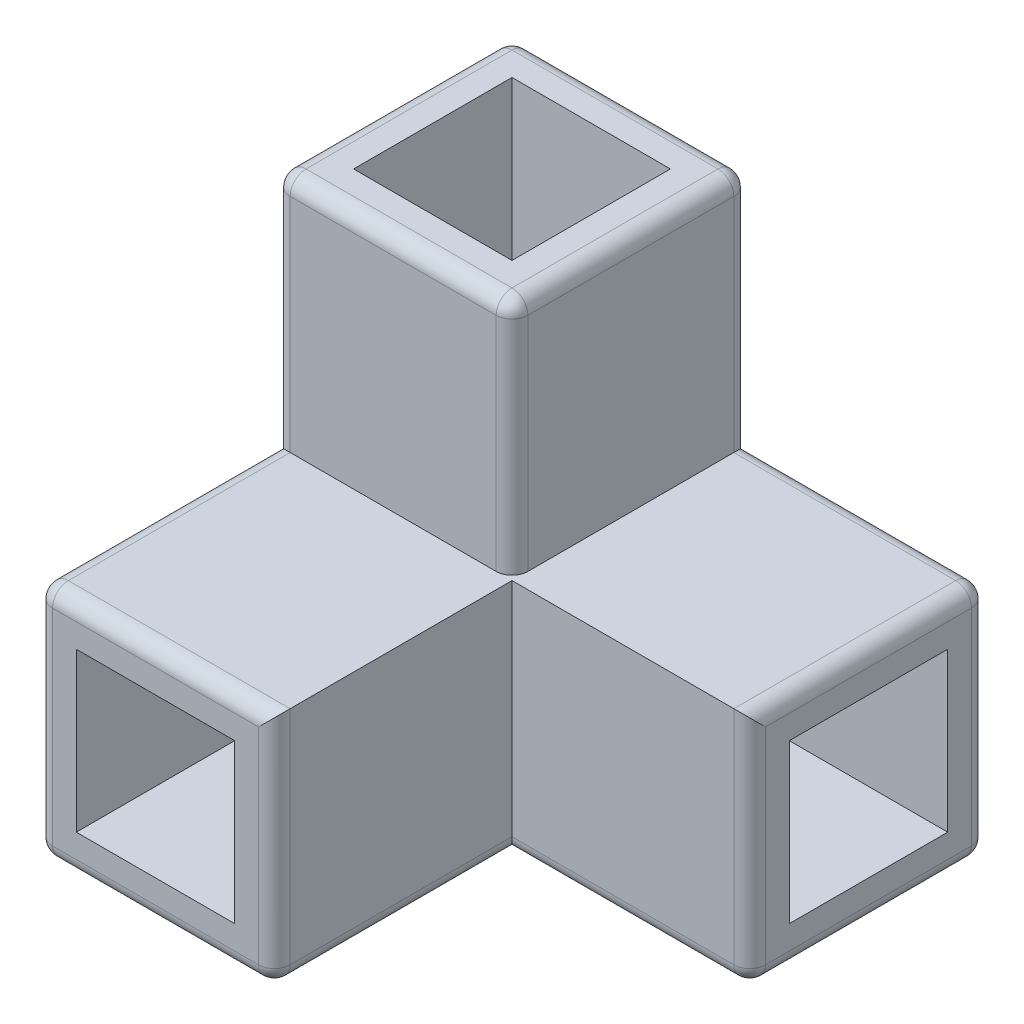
ISO-10303-21;
HEADER;
FILE_DESCRIPTION(('STEP AP214'),'2;1');
FILE_NAME('part.step','',(''),(''),'','','');
FILE_SCHEMA(('AUTOMOTIVE_DESIGN { 1 0 10303 214 1 1 1 1 }'));
ENDSEC;
DATA;
#1=APPLICATION_CONTEXT('core data for automotive mechanical design processes');
#2=APPLICATION_PROTOCOL_DEFINITION('international standard','automotive_design',2000,#1);
#3=PRODUCT_CONTEXT('',#1,'mechanical');
#4=PRODUCT('Part','Part','',(#3));
#5=PRODUCT_RELATED_PRODUCT_CATEGORY('part','',(#4));
#6=PRODUCT_DEFINITION_FORMATION('','',#4);
#7=PRODUCT_DEFINITION_CONTEXT('part definition',#1,'design');
#8=PRODUCT_DEFINITION('design','',#6,#7);
#9=PRODUCT_DEFINITION_SHAPE('','',#8);
#10=(LENGTH_UNIT() NAMED_UNIT(*) SI_UNIT(.MILLI.,.METRE.));
#11=(NAMED_UNIT(*) PLANE_ANGLE_UNIT() SI_UNIT($,.RADIAN.));
#12=(NAMED_UNIT(*) SI_UNIT($,.STERADIAN.) SOLID_ANGLE_UNIT());
#13=UNCERTAINTY_MEASURE_WITH_UNIT(LENGTH_MEASURE(1.E-05),#10,'distance_accuracy_value','');
#14=(GEOMETRIC_REPRESENTATION_CONTEXT(3) GLOBAL_UNCERTAINTY_ASSIGNED_CONTEXT((#13)) GLOBAL_UNIT_ASSIGNED_CONTEXT((#10,
#11,#12)) REPRESENTATION_CONTEXT('',''));
#15=CARTESIAN_POINT('',(0.,0.,0.));
#16=DIRECTION('',(0.,0.,1.));
#17=DIRECTION('',(1.,0.,0.));
#18=AXIS2_PLACEMENT_3D('',#15,#16,#17);
#19=CARTESIAN_POINT('',(0.,0.,30.));
#20=DIRECTION('',(0.,0.,-1.));
#21=DIRECTION('',(-1.,0.,0.));
#22=AXIS2_PLACEMENT_3D('',#19,#20,#21);
#23=PLANE('',#22);
#24=DIRECTION('',(0.,1.,0.));
#25=VECTOR('',#24,1.);
#26=CARTESIAN_POINT('',(30.,0.,30.));
#27=LINE('',#26,#25);
#28=CARTESIAN_POINT('',(30.,2.,30.));
#29=VERTEX_POINT('',#28);
#30=CARTESIAN_POINT('',(30.,30.,30.));
#31=VERTEX_POINT('',#30);
#32=EDGE_CURVE('E410',#29,#31,#27,.T.);
#33=ORIENTED_EDGE('',*,*,#32,.F.);
#34=DIRECTION('',(1.,0.,0.));
#35=VECTOR('',#34,1.);
#36=CARTESIAN_POINT('',(0.,2.,30.));
#37=LINE('',#36,#35);
#38=CARTESIAN_POINT('',(58.,2.,30.));
#39=VERTEX_POINT('',#38);
#40=EDGE_CURVE('E509',#29,#39,#37,.T.);
#41=ORIENTED_EDGE('',*,*,#40,.T.);
#42=DIRECTION('',(0.,1.,0.));
#43=VECTOR('',#42,1.);
#44=CARTESIAN_POINT('',(58.,0.,30.));
#45=LINE('',#44,#43);
#46=CARTESIAN_POINT('',(58.,30.,30.));
#47=VERTEX_POINT('',#46);
#48=EDGE_CURVE('E506',#39,#47,#45,.T.);
#49=ORIENTED_EDGE('',*,*,#48,.T.);
#50=DIRECTION('',(-1.,0.,0.));
#51=VECTOR('',#50,1.);
#52=CARTESIAN_POINT('',(30.,30.,30.));
#53=LINE('',#52,#51);
#54=EDGE_CURVE('E421',#47,#31,#53,.T.);
#55=ORIENTED_EDGE('',*,*,#54,.T.);
#56=EDGE_LOOP('',(#33,#41,#49,#55));
#57=FACE_BOUND('',#56,.T.);
#58=ADVANCED_FACE('F43',(#57),#23,.F.);
#59=DIRECTION('',(-1.,0.,0.));
#60=VECTOR('',#59,1.);
#61=CARTESIAN_POINT('',(30.,30.,30.));
#62=LINE('',#61,#60);
#63=CARTESIAN_POINT('',(28.,30.,30.));
#64=VERTEX_POINT('',#63);
#65=CARTESIAN_POINT('',(2.00000000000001,30.,30.));
#66=VERTEX_POINT('',#65);
#67=EDGE_CURVE('E414',#64,#66,#62,.T.);
#68=ORIENTED_EDGE('',*,*,#67,.F.);
#69=DIRECTION('',(0.,1.,0.));
#70=VECTOR('',#69,1.);
#71=CARTESIAN_POINT('',(28.,0.,30.));
#72=LINE('',#71,#70);
#73=CARTESIAN_POINT('',(28.,58.,30.));
#74=VERTEX_POINT('',#73);
#75=EDGE_CURVE('E552',#64,#74,#72,.T.);
#76=ORIENTED_EDGE('',*,*,#75,.T.);
#77=DIRECTION('',(-1.,0.,0.));
#78=VECTOR('',#77,1.);
#79=CARTESIAN_POINT('',(0.,58.,30.));
#80=LINE('',#79,#78);
#81=CARTESIAN_POINT('',(2.,58.,30.));
#82=VERTEX_POINT('',#81);
#83=EDGE_CURVE('E546',#74,#82,#80,.T.);
#84=ORIENTED_EDGE('',*,*,#83,.T.);
#85=DIRECTION('',(0.,-1.,0.));
#86=VECTOR('',#85,1.);
#87=CARTESIAN_POINT('',(2.,0.,30.));
#88=LINE('',#87,#86);
#89=EDGE_CURVE('E549',#82,#66,#88,.T.);
#90=ORIENTED_EDGE('',*,*,#89,.T.);
#91=EDGE_LOOP('',(#68,#76,#84,#90));
#92=FACE_BOUND('',#91,.T.);
#93=ADVANCED_FACE('F731',(#92),#23,.F.);
#94=CARTESIAN_POINT('',(60.,30.,30.));
#95=DIRECTION('',(-1.,0.,0.));
#96=DIRECTION('',(0.,-1.,0.));
#97=AXIS2_PLACEMENT_3D('',#94,#95,#96);
#98=PLANE('',#97);
#99=DIRECTION('',(0.,0.,1.));
#100=VECTOR('',#99,1.);
#101=CARTESIAN_POINT('',(60.,25.,25.));
#102=LINE('',#101,#100);
#103=CARTESIAN_POINT('',(60.,25.,5.00000000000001));
#104=VERTEX_POINT('',#103);
#105=CARTESIAN_POINT('',(60.,25.,25.));
#106=VERTEX_POINT('',#105);
#107=EDGE_CURVE('E343',#104,#106,#102,.T.);
#108=ORIENTED_EDGE('',*,*,#107,.F.);
#109=DIRECTION('',(0.,1.,0.));
#110=VECTOR('',#109,1.);
#111=CARTESIAN_POINT('',(60.,25.,5.00000000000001));
#112=LINE('',#111,#110);
#113=CARTESIAN_POINT('',(60.,5.,5.));
#114=VERTEX_POINT('',#113);
#115=EDGE_CURVE('E69',#114,#104,#112,.T.);
#116=ORIENTED_EDGE('',*,*,#115,.F.);
#117=DIRECTION('',(0.,0.,-1.));
#118=VECTOR('',#117,1.);
#119=CARTESIAN_POINT('',(60.,5.,25.));
#120=LINE('',#119,#118);
#121=CARTESIAN_POINT('',(60.,5.,25.));
#122=VERTEX_POINT('',#121);
#123=EDGE_CURVE('E328',#122,#114,#120,.T.);
#124=ORIENTED_EDGE('',*,*,#123,.F.);
#125=DIRECTION('',(0.,-1.,0.));
#126=VECTOR('',#125,1.);
#127=CARTESIAN_POINT('',(60.,25.,25.));
#128=LINE('',#127,#126);
#129=EDGE_CURVE('E347',#106,#122,#128,.T.);
#130=ORIENTED_EDGE('',*,*,#129,.F.);
#131=EDGE_LOOP('',(#108,#116,#124,#130));
#132=FACE_BOUND('',#131,.T.);
#133=DIRECTION('',(0.,0.,-1.));
#134=VECTOR('',#133,1.);
#135=CARTESIAN_POINT('',(60.,28.,30.));
#136=LINE('',#135,#134);
#137=CARTESIAN_POINT('',(60.,28.,2.));
#138=VERTEX_POINT('',#137);
#139=CARTESIAN_POINT('',(60.,28.,28.));
#140=VERTEX_POINT('',#139);
#141=EDGE_CURVE('E442',#138,#140,#136,.F.);
#142=ORIENTED_EDGE('',*,*,#141,.T.);
#143=DIRECTION('',(0.,1.,0.));
#144=VECTOR('',#143,1.);
#145=CARTESIAN_POINT('',(60.,30.,28.));
#146=LINE('',#145,#144);
#147=CARTESIAN_POINT('',(60.,2.,28.));
#148=VERTEX_POINT('',#147);
#149=EDGE_CURVE('E446',#140,#148,#146,.F.);
#150=ORIENTED_EDGE('',*,*,#149,.T.);
#151=DIRECTION('',(0.,0.,-1.));
#152=VECTOR('',#151,1.);
#153=CARTESIAN_POINT('',(60.,2.,30.));
#154=LINE('',#153,#152);
#155=CARTESIAN_POINT('',(60.,2.,2.));
#156=VERTEX_POINT('',#155);
#157=EDGE_CURVE('E439',#148,#156,#154,.T.);
#158=ORIENTED_EDGE('',*,*,#157,.T.);
#159=DIRECTION('',(0.,1.,0.));
#160=VECTOR('',#159,1.);
#161=CARTESIAN_POINT('',(60.,30.,2.));
#162=LINE('',#161,#160);
#163=EDGE_CURVE('E436',#156,#138,#162,.T.);
#164=ORIENTED_EDGE('',*,*,#163,.T.);
#165=EDGE_LOOP('',(#142,#150,#158,#164));
#166=FACE_BOUND('',#165,.T.);
#167=ADVANCED_FACE('F788',(#132,#166),#98,.F.);
#168=CARTESIAN_POINT('',(30.,30.,30.));
#169=DIRECTION('',(0.,-1.,0.));
#170=DIRECTION('',(0.,0.,-1.));
#171=AXIS2_PLACEMENT_3D('',#168,#169,#170);
#172=PLANE('',#171);
#173=ORIENTED_EDGE('',*,*,#54,.F.);
#174=DIRECTION('',(0.,0.,-1.));
#175=VECTOR('',#174,1.);
#176=CARTESIAN_POINT('',(58.,30.,30.));
#177=LINE('',#176,#175);
#178=CARTESIAN_POINT('',(58.,30.,2.));
#179=VERTEX_POINT('',#178);
#180=EDGE_CURVE('E432',#47,#179,#177,.T.);
#181=ORIENTED_EDGE('',*,*,#180,.T.);
#182=DIRECTION('',(-1.,0.,0.));
#183=VECTOR('',#182,1.);
#184=CARTESIAN_POINT('',(30.,30.,2.));
#185=LINE('',#184,#183);
#186=CARTESIAN_POINT('',(30.,30.,2.));
#187=VERTEX_POINT('',#186);
#188=EDGE_CURVE('E429',#179,#187,#185,.T.);
#189=ORIENTED_EDGE('',*,*,#188,.T.);
#190=DIRECTION('',(0.,0.,-1.));
#191=VECTOR('',#190,1.);
#192=CARTESIAN_POINT('',(30.,30.,30.));
#193=LINE('',#192,#191);
#194=CARTESIAN_POINT('',(30.,30.,28.));
#195=VERTEX_POINT('',#194);
#196=EDGE_CURVE('E425',#195,#187,#193,.T.);
#197=ORIENTED_EDGE('',*,*,#196,.F.);
#198=CARTESIAN_POINT('',(28.,30.,28.));
#199=DIRECTION('',(0.,-1.,0.));
#200=DIRECTION('',(0.,0.,-1.));
#201=AXIS2_PLACEMENT_3D('',#198,#199,#200);
#202=CIRCLE('',#201,2.);
#203=EDGE_CURVE('E11',#195,#64,#202,.T.);
#204=ORIENTED_EDGE('',*,*,#203,.T.);
#205=ORIENTED_EDGE('',*,*,#67,.T.);
#206=DIRECTION('',(0.,0.,-1.));
#207=VECTOR('',#206,1.);
#208=CARTESIAN_POINT('',(2.,30.,60.));
#209=LINE('',#208,#207);
#210=CARTESIAN_POINT('',(2.,30.,58.));
#211=VERTEX_POINT('',#210);
#212=EDGE_CURVE('E531',#66,#211,#209,.F.);
#213=ORIENTED_EDGE('',*,*,#212,.T.);
#214=DIRECTION('',(-1.,0.,0.));
#215=VECTOR('',#214,1.);
#216=CARTESIAN_POINT('',(30.,30.,58.));
#217=LINE('',#216,#215);
#218=CARTESIAN_POINT('',(30.,30.,58.));
#219=VERTEX_POINT('',#218);
#220=EDGE_CURVE('E534',#211,#219,#217,.F.);
#221=ORIENTED_EDGE('',*,*,#220,.T.);
#222=DIRECTION('',(0.,0.,-1.));
#223=VECTOR('',#222,1.);
#224=CARTESIAN_POINT('',(30.,30.,60.));
#225=LINE('',#224,#223);
#226=EDGE_CURVE('E418',#219,#31,#225,.T.);
#227=ORIENTED_EDGE('',*,*,#226,.T.);
#228=EDGE_LOOP('',(#173,#181,#189,#197,#204,#205,#213,#221,#227));
#229=FACE_BOUND('',#228,.T.);
#230=ADVANCED_FACE('F724',(#229),#172,.F.);
#231=CARTESIAN_POINT('',(30.,60.,30.));
#232=DIRECTION('',(-1.,0.,0.));
#233=DIRECTION('',(0.,-1.,0.));
#234=AXIS2_PLACEMENT_3D('',#231,#232,#233);
#235=PLANE('',#234);
#236=ORIENTED_EDGE('',*,*,#196,.T.);
#237=DIRECTION('',(0.,1.,0.));
#238=VECTOR('',#237,1.);
#239=CARTESIAN_POINT('',(30.,60.,2.));
#240=LINE('',#239,#238);
#241=CARTESIAN_POINT('',(30.,58.,2.));
#242=VERTEX_POINT('',#241);
#243=EDGE_CURVE('E543',#187,#242,#240,.T.);
#244=ORIENTED_EDGE('',*,*,#243,.T.);
#245=DIRECTION('',(0.,0.,-1.));
#246=VECTOR('',#245,1.);
#247=CARTESIAN_POINT('',(30.,58.,30.));
#248=LINE('',#247,#246);
#249=CARTESIAN_POINT('',(30.,58.,28.));
#250=VERTEX_POINT('',#249);
#251=EDGE_CURVE('E537',#242,#250,#248,.F.);
#252=ORIENTED_EDGE('',*,*,#251,.T.);
#253=DIRECTION('',(0.,1.,0.));
#254=VECTOR('',#253,1.);
#255=CARTESIAN_POINT('',(30.,60.,28.));
#256=LINE('',#255,#254);
#257=EDGE_CURVE('E540',#250,#195,#256,.F.);
#258=ORIENTED_EDGE('',*,*,#257,.T.);
#259=EDGE_LOOP('',(#236,#244,#252,#258));
#260=FACE_BOUND('',#259,.T.);
#261=ADVANCED_FACE('F808',(#260),#235,.F.);
#262=CARTESIAN_POINT('',(0.,60.,30.));
#263=DIRECTION('',(0.,-1.,0.));
#264=DIRECTION('',(0.,0.,-1.));
#265=AXIS2_PLACEMENT_3D('',#262,#263,#264);
#266=PLANE('',#265);
#267=DIRECTION('',(-1.,0.,0.));
#268=VECTOR('',#267,1.);
#269=CARTESIAN_POINT('',(5.,60.,5.));
#270=LINE('',#269,#268);
#271=CARTESIAN_POINT('',(25.,60.,5.));
#272=VERTEX_POINT('',#271);
#273=CARTESIAN_POINT('',(5.,60.,5.));
#274=VERTEX_POINT('',#273);
#275=EDGE_CURVE('E309',#272,#274,#270,.T.);
#276=ORIENTED_EDGE('',*,*,#275,.F.);
#277=DIRECTION('',(0.,0.,-1.));
#278=VECTOR('',#277,1.);
#279=CARTESIAN_POINT('',(25.,60.,5.));
#280=LINE('',#279,#278);
#281=CARTESIAN_POINT('',(25.,60.,25.));
#282=VERTEX_POINT('',#281);
#283=EDGE_CURVE('E61',#282,#272,#280,.T.);
#284=ORIENTED_EDGE('',*,*,#283,.F.);
#285=DIRECTION('',(1.,0.,0.));
#286=VECTOR('',#285,1.);
#287=CARTESIAN_POINT('',(5.,60.,25.));
#288=LINE('',#287,#286);
#289=CARTESIAN_POINT('',(5.,60.,25.));
#290=VERTEX_POINT('',#289);
#291=EDGE_CURVE('E296',#290,#282,#288,.T.);
#292=ORIENTED_EDGE('',*,*,#291,.F.);
#293=DIRECTION('',(0.,0.,1.));
#294=VECTOR('',#293,1.);
#295=CARTESIAN_POINT('',(5.,60.,5.));
#296=LINE('',#295,#294);
#297=EDGE_CURVE('E300',#274,#290,#296,.T.);
#298=ORIENTED_EDGE('',*,*,#297,.F.);
#299=EDGE_LOOP('',(#276,#284,#292,#298));
#300=FACE_BOUND('',#299,.T.);
#301=DIRECTION('',(0.,0.,-1.));
#302=VECTOR('',#301,1.);
#303=CARTESIAN_POINT('',(2.,60.,30.));
#304=LINE('',#303,#302);
#305=CARTESIAN_POINT('',(2.,60.,2.));
#306=VERTEX_POINT('',#305);
#307=CARTESIAN_POINT('',(2.,60.,28.));
#308=VERTEX_POINT('',#307);
#309=EDGE_CURVE('E555',#306,#308,#304,.F.);
#310=ORIENTED_EDGE('',*,*,#309,.T.);
#311=DIRECTION('',(-1.,0.,0.));
#312=VECTOR('',#311,1.);
#313=CARTESIAN_POINT('',(0.,60.,28.));
#314=LINE('',#313,#312);
#315=CARTESIAN_POINT('',(28.,60.,28.));
#316=VERTEX_POINT('',#315);
#317=EDGE_CURVE('E53',#308,#316,#314,.F.);
#318=ORIENTED_EDGE('',*,*,#317,.T.);
#319=DIRECTION('',(0.,0.,-1.));
#320=VECTOR('',#319,1.);
#321=CARTESIAN_POINT('',(28.,60.,30.));
#322=LINE('',#321,#320);
#323=CARTESIAN_POINT('',(28.,60.,2.));
#324=VERTEX_POINT('',#323);
#325=EDGE_CURVE('E561',#316,#324,#322,.T.);
#326=ORIENTED_EDGE('',*,*,#325,.T.);
#327=DIRECTION('',(-1.,0.,0.));
#328=VECTOR('',#327,1.);
#329=CARTESIAN_POINT('',(0.,60.,2.));
#330=LINE('',#329,#328);
#331=EDGE_CURVE('E558',#324,#306,#330,.T.);
#332=ORIENTED_EDGE('',*,*,#331,.T.);
#333=EDGE_LOOP('',(#310,#318,#326,#332));
#334=FACE_BOUND('',#333,.T.);
#335=ADVANCED_FACE('F751',(#300,#334),#266,.F.);
#336=CARTESIAN_POINT('',(0.,0.,30.));
#337=DIRECTION('',(1.,0.,0.));
#338=DIRECTION('',(0.,0.,-1.));
#339=AXIS2_PLACEMENT_3D('',#336,#337,#338);
#340=PLANE('',#339);
#341=DIRECTION('',(0.,-1.,0.));
#342=VECTOR('',#341,1.);
#343=CARTESIAN_POINT('',(0.,0.,2.));
#344=LINE('',#343,#342);
#345=CARTESIAN_POINT('',(0.,58.,2.));
#346=VERTEX_POINT('',#345);
#347=CARTESIAN_POINT('',(0.,2.,2.));
#348=VERTEX_POINT('',#347);
#349=EDGE_CURVE('E474',#346,#348,#344,.T.);
#350=ORIENTED_EDGE('',*,*,#349,.T.);
#351=DIRECTION('',(0.,0.,-1.));
#352=VECTOR('',#351,1.);
#353=CARTESIAN_POINT('',(0.,2.,30.));
#354=LINE('',#353,#352);
#355=CARTESIAN_POINT('',(0.,2.,58.));
#356=VERTEX_POINT('',#355);
#357=EDGE_CURVE('E483',#348,#356,#354,.F.);
#358=ORIENTED_EDGE('',*,*,#357,.T.);
#359=DIRECTION('',(0.,-1.,0.));
#360=VECTOR('',#359,1.);
#361=CARTESIAN_POINT('',(0.,30.,58.));
#362=LINE('',#361,#360);
#363=CARTESIAN_POINT('',(0.,28.,58.));
#364=VERTEX_POINT('',#363);
#365=EDGE_CURVE('E480',#356,#364,#362,.F.);
#366=ORIENTED_EDGE('',*,*,#365,.T.);
#367=DIRECTION('',(0.,0.,-1.));
#368=VECTOR('',#367,1.);
#369=CARTESIAN_POINT('',(0.,28.,30.));
#370=LINE('',#369,#368);
#371=CARTESIAN_POINT('',(0.,28.,28.));
#372=VERTEX_POINT('',#371);
#373=EDGE_CURVE('E477',#364,#372,#370,.T.);
#374=ORIENTED_EDGE('',*,*,#373,.T.);
#375=DIRECTION('',(0.,-1.,0.));
#376=VECTOR('',#375,1.);
#377=CARTESIAN_POINT('',(0.,0.,28.));
#378=LINE('',#377,#376);
#379=CARTESIAN_POINT('',(0.,58.,28.));
#380=VERTEX_POINT('',#379);
#381=EDGE_CURVE('E471',#372,#380,#378,.F.);
#382=ORIENTED_EDGE('',*,*,#381,.T.);
#383=DIRECTION('',(0.,0.,-1.));
#384=VECTOR('',#383,1.);
#385=CARTESIAN_POINT('',(0.,58.,30.));
#386=LINE('',#385,#384);
#387=EDGE_CURVE('E468',#380,#346,#386,.T.);
#388=ORIENTED_EDGE('',*,*,#387,.T.);
#389=EDGE_LOOP('',(#350,#358,#366,#374,#382,#388));
#390=FACE_BOUND('',#389,.T.);
#391=ADVANCED_FACE('F801',(#390),#340,.F.);
#392=CARTESIAN_POINT('',(60.,0.,30.));
#393=DIRECTION('',(0.,1.,0.));
#394=DIRECTION('',(-1.,0.,0.));
#395=AXIS2_PLACEMENT_3D('',#392,#393,#394);
#396=PLANE('',#395);
#397=DIRECTION('',(1.,0.,0.));
#398=VECTOR('',#397,1.);
#399=CARTESIAN_POINT('',(0.,0.,58.));
#400=LINE('',#399,#398);
#401=CARTESIAN_POINT('',(28.,0.,58.));
#402=VERTEX_POINT('',#401);
#403=CARTESIAN_POINT('',(2.,0.,58.));
#404=VERTEX_POINT('',#403);
#405=EDGE_CURVE('E449',#402,#404,#400,.F.);
#406=ORIENTED_EDGE('',*,*,#405,.T.);
#407=DIRECTION('',(0.,0.,-1.));
#408=VECTOR('',#407,1.);
#409=CARTESIAN_POINT('',(2.,0.,30.));
#410=LINE('',#409,#408);
#411=CARTESIAN_POINT('',(2.,0.,2.));
#412=VERTEX_POINT('',#411);
#413=EDGE_CURVE('E464',#404,#412,#410,.T.);
#414=ORIENTED_EDGE('',*,*,#413,.T.);
#415=DIRECTION('',(1.,0.,0.));
#416=VECTOR('',#415,1.);
#417=CARTESIAN_POINT('',(60.,0.,2.));
#418=LINE('',#417,#416);
#419=CARTESIAN_POINT('',(58.,0.,2.));
#420=VERTEX_POINT('',#419);
#421=EDGE_CURVE('E461',#412,#420,#418,.T.);
#422=ORIENTED_EDGE('',*,*,#421,.T.);
#423=DIRECTION('',(0.,0.,-1.));
#424=VECTOR('',#423,1.);
#425=CARTESIAN_POINT('',(58.,0.,30.));
#426=LINE('',#425,#424);
#427=CARTESIAN_POINT('',(58.,0.,28.));
#428=VERTEX_POINT('',#427);
#429=EDGE_CURVE('E458',#420,#428,#426,.F.);
#430=ORIENTED_EDGE('',*,*,#429,.T.);
#431=DIRECTION('',(1.,0.,0.));
#432=VECTOR('',#431,1.);
#433=CARTESIAN_POINT('',(60.,0.,28.));
#434=LINE('',#433,#432);
#435=CARTESIAN_POINT('',(28.,0.,28.));
#436=VERTEX_POINT('',#435);
#437=EDGE_CURVE('E455',#428,#436,#434,.F.);
#438=ORIENTED_EDGE('',*,*,#437,.T.);
#439=DIRECTION('',(0.,0.,-1.));
#440=VECTOR('',#439,1.);
#441=CARTESIAN_POINT('',(28.,0.,30.));
#442=LINE('',#441,#440);
#443=EDGE_CURVE('E452',#436,#402,#442,.F.);
#444=ORIENTED_EDGE('',*,*,#443,.T.);
#445=EDGE_LOOP('',(#406,#414,#422,#430,#438,#444));
#446=FACE_BOUND('',#445,.T.);
#447=ADVANCED_FACE('F797',(#446),#396,.F.);
#448=CARTESIAN_POINT('',(0.,0.,0.));
#449=DIRECTION('',(0.,0.,-1.));
#450=DIRECTION('',(-1.,0.,0.));
#451=AXIS2_PLACEMENT_3D('',#448,#449,#450);
#452=PLANE('',#451);
#453=DIRECTION('',(0.,1.,0.));
#454=VECTOR('',#453,1.);
#455=CARTESIAN_POINT('',(58.,0.,0.));
#456=LINE('',#455,#454);
#457=CARTESIAN_POINT('',(58.,28.,0.));
#458=VERTEX_POINT('',#457);
#459=CARTESIAN_POINT('',(58.,2.,0.));
#460=VERTEX_POINT('',#459);
#461=EDGE_CURVE('E499',#458,#460,#456,.F.);
#462=ORIENTED_EDGE('',*,*,#461,.T.);
#463=DIRECTION('',(1.,0.,0.));
#464=VECTOR('',#463,1.);
#465=CARTESIAN_POINT('',(0.,2.,0.));
#466=LINE('',#465,#464);
#467=CARTESIAN_POINT('',(2.,2.,0.));
#468=VERTEX_POINT('',#467);
#469=EDGE_CURVE('E502',#460,#468,#466,.F.);
#470=ORIENTED_EDGE('',*,*,#469,.T.);
#471=DIRECTION('',(0.,-1.,0.));
#472=VECTOR('',#471,1.);
#473=CARTESIAN_POINT('',(2.,60.,0.));
#474=LINE('',#473,#472);
#475=CARTESIAN_POINT('',(2.,58.,0.));
#476=VERTEX_POINT('',#475);
#477=EDGE_CURVE('E490',#468,#476,#474,.F.);
#478=ORIENTED_EDGE('',*,*,#477,.T.);
#479=DIRECTION('',(-1.,0.,0.));
#480=VECTOR('',#479,1.);
#481=CARTESIAN_POINT('',(30.,58.,0.));
#482=LINE('',#481,#480);
#483=CARTESIAN_POINT('',(28.,58.,0.));
#484=VERTEX_POINT('',#483);
#485=EDGE_CURVE('E487',#476,#484,#482,.F.);
#486=ORIENTED_EDGE('',*,*,#485,.T.);
#487=DIRECTION('',(0.,1.,0.));
#488=VECTOR('',#487,1.);
#489=CARTESIAN_POINT('',(28.,30.,0.));
#490=LINE('',#489,#488);
#491=CARTESIAN_POINT('',(28.,28.,0.));
#492=VERTEX_POINT('',#491);
#493=EDGE_CURVE('E493',#484,#492,#490,.F.);
#494=ORIENTED_EDGE('',*,*,#493,.T.);
#495=DIRECTION('',(-1.,0.,0.));
#496=VECTOR('',#495,1.);
#497=CARTESIAN_POINT('',(60.,28.,0.));
#498=LINE('',#497,#496);
#499=EDGE_CURVE('E496',#492,#458,#498,.F.);
#500=ORIENTED_EDGE('',*,*,#499,.T.);
#501=EDGE_LOOP('',(#462,#470,#478,#486,#494,#500));
#502=FACE_BOUND('',#501,.T.);
#503=ADVANCED_FACE('F794',(#502),#452,.T.);
#504=CARTESIAN_POINT('',(30.,0.,60.));
#505=DIRECTION('',(-1.,0.,0.));
#506=DIRECTION('',(0.,-1.,0.));
#507=AXIS2_PLACEMENT_3D('',#504,#505,#506);
#508=PLANE('',#507);
#509=DIRECTION('',(0.,1.,0.));
#510=VECTOR('',#509,1.);
#511=CARTESIAN_POINT('',(30.,0.,58.));
#512=LINE('',#511,#510);
#513=CARTESIAN_POINT('',(30.,2.,58.));
#514=VERTEX_POINT('',#513);
#515=EDGE_CURVE('E512',#219,#514,#512,.F.);
#516=ORIENTED_EDGE('',*,*,#515,.T.);
#517=DIRECTION('',(0.,0.,-1.));
#518=VECTOR('',#517,1.);
#519=CARTESIAN_POINT('',(30.,2.,60.));
#520=LINE('',#519,#518);
#521=EDGE_CURVE('E515',#514,#29,#520,.T.);
#522=ORIENTED_EDGE('',*,*,#521,.T.);
#523=ORIENTED_EDGE('',*,*,#32,.T.);
#524=ORIENTED_EDGE('',*,*,#226,.F.);
#525=EDGE_LOOP('',(#516,#522,#523,#524));
#526=FACE_BOUND('',#525,.T.);
#527=ADVANCED_FACE('F792',(#526),#508,.F.);
#528=CARTESIAN_POINT('',(0.,0.,60.));
#529=DIRECTION('',(0.,0.,1.));
#530=DIRECTION('',(1.,0.,0.));
#531=AXIS2_PLACEMENT_3D('',#528,#529,#530);
#532=PLANE('',#531);
#533=DIRECTION('',(0.,1.,0.));
#534=VECTOR('',#533,1.);
#535=CARTESIAN_POINT('',(25.,25.,60.));
#536=LINE('',#535,#534);
#537=CARTESIAN_POINT('',(25.,5.,60.));
#538=VERTEX_POINT('',#537);
#539=CARTESIAN_POINT('',(25.,25.,60.));
#540=VERTEX_POINT('',#539);
#541=EDGE_CURVE('E357',#538,#540,#536,.T.);
#542=ORIENTED_EDGE('',*,*,#541,.F.);
#543=DIRECTION('',(1.,0.,0.));
#544=VECTOR('',#543,1.);
#545=CARTESIAN_POINT('',(5.,5.,60.));
#546=LINE('',#545,#544);
#547=CARTESIAN_POINT('',(5.,5.,60.));
#548=VERTEX_POINT('',#547);
#549=EDGE_CURVE('E371',#548,#538,#546,.T.);
#550=ORIENTED_EDGE('',*,*,#549,.F.);
#551=DIRECTION('',(0.,-1.,0.));
#552=VECTOR('',#551,1.);
#553=CARTESIAN_POINT('',(5.00000000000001,25.,60.));
#554=LINE('',#553,#552);
#555=CARTESIAN_POINT('',(5.00000000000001,25.,60.));
#556=VERTEX_POINT('',#555);
#557=EDGE_CURVE('E390',#556,#548,#554,.T.);
#558=ORIENTED_EDGE('',*,*,#557,.F.);
#559=DIRECTION('',(-1.,0.,0.));
#560=VECTOR('',#559,1.);
#561=CARTESIAN_POINT('',(5.00000000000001,25.,60.));
#562=LINE('',#561,#560);
#563=EDGE_CURVE('E386',#540,#556,#562,.T.);
#564=ORIENTED_EDGE('',*,*,#563,.F.);
#565=EDGE_LOOP('',(#542,#550,#558,#564));
#566=FACE_BOUND('',#565,.T.);
#567=DIRECTION('',(1.,0.,0.));
#568=VECTOR('',#567,1.);
#569=CARTESIAN_POINT('',(30.,2.,60.));
#570=LINE('',#569,#568);
#571=CARTESIAN_POINT('',(2.,2.,60.));
#572=VERTEX_POINT('',#571);
#573=CARTESIAN_POINT('',(28.,2.,60.));
#574=VERTEX_POINT('',#573);
#575=EDGE_CURVE('E524',#572,#574,#570,.T.);
#576=ORIENTED_EDGE('',*,*,#575,.T.);
#577=DIRECTION('',(0.,1.,0.));
#578=VECTOR('',#577,1.);
#579=CARTESIAN_POINT('',(28.,30.,60.));
#580=LINE('',#579,#578);
#581=CARTESIAN_POINT('',(28.,28.,60.));
#582=VERTEX_POINT('',#581);
#583=EDGE_CURVE('E528',#574,#582,#580,.T.);
#584=ORIENTED_EDGE('',*,*,#583,.T.);
#585=DIRECTION('',(-1.,0.,0.));
#586=VECTOR('',#585,1.);
#587=CARTESIAN_POINT('',(0.,28.,60.));
#588=LINE('',#587,#586);
#589=CARTESIAN_POINT('',(2.,28.,60.));
#590=VERTEX_POINT('',#589);
#591=EDGE_CURVE('E521',#582,#590,#588,.T.);
#592=ORIENTED_EDGE('',*,*,#591,.T.);
#593=DIRECTION('',(0.,-1.,0.));
#594=VECTOR('',#593,1.);
#595=CARTESIAN_POINT('',(2.,0.,60.));
#596=LINE('',#595,#594);
#597=EDGE_CURVE('E518',#590,#572,#596,.T.);
#598=ORIENTED_EDGE('',*,*,#597,.T.);
#599=EDGE_LOOP('',(#576,#584,#592,#598));
#600=FACE_BOUND('',#599,.T.);
#601=ADVANCED_FACE('F924',(#566,#600),#532,.T.);
#602=CARTESIAN_POINT('',(2.,28.,30.));
#603=DIRECTION('',(0.,0.,-1.));
#604=DIRECTION('',(-1.,0.,0.));
#605=AXIS2_PLACEMENT_3D('',#602,#603,#604);
#606=CYLINDRICAL_SURFACE('',#605,2.);
#607=CARTESIAN_POINT('',(2.,28.,58.));
#608=DIRECTION('',(0.,0.,1.));
#609=DIRECTION('',(1.,0.,0.));
#610=AXIS2_PLACEMENT_3D('',#607,#608,#609);
#611=CIRCLE('',#610,2.);
#612=EDGE_CURVE('E704',#211,#364,#611,.T.);
#613=ORIENTED_EDGE('',*,*,#612,.F.);
#614=ORIENTED_EDGE('',*,*,#212,.F.);
#615=CARTESIAN_POINT('',(2.,28.,28.));
#616=DIRECTION('',(0.,0.707106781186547,-0.707106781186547));
#617=DIRECTION('',(0.,-0.707106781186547,-0.707106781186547));
#618=AXIS2_PLACEMENT_3D('',#615,#616,#617);
#619=ELLIPSE('',#618,2.82842712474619,2.);
#620=EDGE_CURVE('E47',#372,#66,#619,.T.);
#621=ORIENTED_EDGE('',*,*,#620,.F.);
#622=ORIENTED_EDGE('',*,*,#373,.F.);
#623=EDGE_LOOP('',(#613,#614,#621,#622));
#624=FACE_BOUND('',#623,.T.);
#625=ADVANCED_FACE('F45',(#624),#606,.T.);
#626=CARTESIAN_POINT('',(2.,0.,28.));
#627=DIRECTION('',(0.,-1.,0.));
#628=DIRECTION('',(0.,0.,-1.));
#629=AXIS2_PLACEMENT_3D('',#626,#627,#628);
#630=CYLINDRICAL_SURFACE('',#629,2.);
#631=ORIENTED_EDGE('',*,*,#620,.T.);
#632=ORIENTED_EDGE('',*,*,#89,.F.);
#633=CARTESIAN_POINT('',(2.,58.,28.));
#634=DIRECTION('',(0.,1.,0.));
#635=DIRECTION('',(0.,0.,1.));
#636=AXIS2_PLACEMENT_3D('',#633,#634,#635);
#637=CIRCLE('',#636,2.);
#638=EDGE_CURVE('E701',#380,#82,#637,.T.);
#639=ORIENTED_EDGE('',*,*,#638,.F.);
#640=ORIENTED_EDGE('',*,*,#381,.F.);
#641=EDGE_LOOP('',(#631,#632,#639,#640));
#642=FACE_BOUND('',#641,.T.);
#643=ADVANCED_FACE('F717',(#642),#630,.T.);
#644=CARTESIAN_POINT('',(2.,28.,58.));
#645=DIRECTION('',(-1.,0.,0.));
#646=DIRECTION('',(0.,0.,1.));
#647=AXIS2_PLACEMENT_3D('',#644,#645,#646);
#648=SPHERICAL_SURFACE('',#647,2.);
#649=CARTESIAN_POINT('',(2.,28.,58.));
#650=DIRECTION('',(-1.,0.,0.));
#651=DIRECTION('',(0.,-1.,0.));
#652=AXIS2_PLACEMENT_3D('',#649,#650,#651);
#653=CIRCLE('',#652,2.);
#654=EDGE_CURVE('E693',#211,#590,#653,.F.);
#655=ORIENTED_EDGE('',*,*,#654,.F.);
#656=ORIENTED_EDGE('',*,*,#612,.T.);
#657=CARTESIAN_POINT('',(2.,28.,58.));
#658=DIRECTION('',(0.,1.,0.));
#659=DIRECTION('',(0.,0.,1.));
#660=AXIS2_PLACEMENT_3D('',#657,#658,#659);
#661=CIRCLE('',#660,2.);
#662=EDGE_CURVE('E697',#590,#364,#661,.F.);
#663=ORIENTED_EDGE('',*,*,#662,.F.);
#664=EDGE_LOOP('',(#655,#656,#663));
#665=FACE_BOUND('',#664,.T.);
#666=ADVANCED_FACE('F772',(#665),#648,.T.);
#667=CARTESIAN_POINT('',(2.,58.,28.));
#668=DIRECTION('',(0.,0.,1.));
#669=DIRECTION('',(1.,0.,0.));
#670=AXIS2_PLACEMENT_3D('',#667,#668,#669);
#671=SPHERICAL_SURFACE('',#670,2.);
#672=CARTESIAN_POINT('',(2.,58.,28.));
#673=DIRECTION('',(0.,0.,1.));
#674=DIRECTION('',(1.,0.,0.));
#675=AXIS2_PLACEMENT_3D('',#672,#673,#674);
#676=CIRCLE('',#675,2.);
#677=EDGE_CURVE('E685',#380,#308,#676,.F.);
#678=ORIENTED_EDGE('',*,*,#677,.F.);
#679=ORIENTED_EDGE('',*,*,#638,.T.);
#680=CARTESIAN_POINT('',(2.,58.,28.));
#681=DIRECTION('',(-1.,0.,0.));
#682=DIRECTION('',(0.,0.,1.));
#683=AXIS2_PLACEMENT_3D('',#680,#681,#682);
#684=CIRCLE('',#683,2.);
#685=EDGE_CURVE('E689',#308,#82,#684,.F.);
#686=ORIENTED_EDGE('',*,*,#685,.F.);
#687=EDGE_LOOP('',(#678,#679,#686));
#688=FACE_BOUND('',#687,.T.);
#689=ADVANCED_FACE('F769',(#688),#671,.T.);
#690=CARTESIAN_POINT('',(2.,0.,58.));
#691=DIRECTION('',(0.,1.,0.));
#692=DIRECTION('',(0.,0.,1.));
#693=AXIS2_PLACEMENT_3D('',#690,#691,#692);
#694=CYLINDRICAL_SURFACE('',#693,2.);
#695=ORIENTED_EDGE('',*,*,#662,.T.);
#696=ORIENTED_EDGE('',*,*,#365,.F.);
#697=CARTESIAN_POINT('',(2.,2.,58.));
#698=DIRECTION('',(0.,-1.,0.));
#699=DIRECTION('',(0.,0.,-1.));
#700=AXIS2_PLACEMENT_3D('',#697,#698,#699);
#701=CIRCLE('',#700,2.);
#702=EDGE_CURVE('E681',#572,#356,#701,.T.);
#703=ORIENTED_EDGE('',*,*,#702,.F.);
#704=ORIENTED_EDGE('',*,*,#597,.F.);
#705=EDGE_LOOP('',(#695,#696,#703,#704));
#706=FACE_BOUND('',#705,.T.);
#707=ADVANCED_FACE('F771',(#706),#694,.T.);
#708=CARTESIAN_POINT('',(0.,28.,58.));
#709=DIRECTION('',(1.,0.,0.));
#710=DIRECTION('',(0.,1.,0.));
#711=AXIS2_PLACEMENT_3D('',#708,#709,#710);
#712=CYLINDRICAL_SURFACE('',#711,2.);
#713=ORIENTED_EDGE('',*,*,#654,.T.);
#714=ORIENTED_EDGE('',*,*,#591,.F.);
#715=CARTESIAN_POINT('',(28.,28.,58.));
#716=DIRECTION('',(0.707106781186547,-0.707106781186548,0.));
#717=DIRECTION('',(-0.707106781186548,-0.707106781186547,0.));
#718=AXIS2_PLACEMENT_3D('',#715,#716,#717);
#719=ELLIPSE('',#718,2.82842712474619,2.);
#720=EDGE_CURVE('E673',#219,#582,#719,.T.);
#721=ORIENTED_EDGE('',*,*,#720,.F.);
#722=ORIENTED_EDGE('',*,*,#220,.F.);
#723=EDGE_LOOP('',(#713,#714,#721,#722));
#724=FACE_BOUND('',#723,.T.);
#725=ADVANCED_FACE('F778',(#724),#712,.T.);
#726=CARTESIAN_POINT('',(28.,0.,28.));
#727=DIRECTION('',(0.,1.,0.));
#728=DIRECTION('',(-1.,0.,0.));
#729=AXIS2_PLACEMENT_3D('',#726,#727,#728);
#730=CYLINDRICAL_SURFACE('',#729,2.);
#731=ORIENTED_EDGE('',*,*,#203,.F.);
#732=ORIENTED_EDGE('',*,*,#257,.F.);
#733=CARTESIAN_POINT('',(28.,58.,28.));
#734=DIRECTION('',(0.,1.,0.));
#735=DIRECTION('',(0.,0.,1.));
#736=AXIS2_PLACEMENT_3D('',#733,#734,#735);
#737=CIRCLE('',#736,2.);
#738=EDGE_CURVE('E669',#74,#250,#737,.T.);
#739=ORIENTED_EDGE('',*,*,#738,.F.);
#740=ORIENTED_EDGE('',*,*,#75,.F.);
#741=EDGE_LOOP('',(#731,#732,#739,#740));
#742=FACE_BOUND('',#741,.T.);
#743=ADVANCED_FACE('F741',(#742),#730,.T.);
#744=CARTESIAN_POINT('',(0.,58.,28.));
#745=DIRECTION('',(-1.,0.,0.));
#746=DIRECTION('',(0.,0.,1.));
#747=AXIS2_PLACEMENT_3D('',#744,#745,#746);
#748=CYLINDRICAL_SURFACE('',#747,2.);
#749=ORIENTED_EDGE('',*,*,#685,.T.);
#750=ORIENTED_EDGE('',*,*,#83,.F.);
#751=CARTESIAN_POINT('',(28.,58.,28.));
#752=DIRECTION('',(1.,0.,0.));
#753=DIRECTION('',(0.,0.,-1.));
#754=AXIS2_PLACEMENT_3D('',#751,#752,#753);
#755=CIRCLE('',#754,2.);
#756=EDGE_CURVE('E665',#316,#74,#755,.T.);
#757=ORIENTED_EDGE('',*,*,#756,.F.);
#758=ORIENTED_EDGE('',*,*,#317,.F.);
#759=EDGE_LOOP('',(#749,#750,#757,#758));
#760=FACE_BOUND('',#759,.T.);
#761=ADVANCED_FACE('F736',(#760),#748,.T.);
#762=CARTESIAN_POINT('',(2.,58.,30.));
#763=DIRECTION('',(0.,0.,-1.));
#764=DIRECTION('',(-1.,0.,0.));
#765=AXIS2_PLACEMENT_3D('',#762,#763,#764);
#766=CYLINDRICAL_SURFACE('',#765,2.);
#767=ORIENTED_EDGE('',*,*,#677,.T.);
#768=ORIENTED_EDGE('',*,*,#309,.F.);
#769=CARTESIAN_POINT('',(2.,58.,2.));
#770=DIRECTION('',(0.,0.,-1.));
#771=DIRECTION('',(-1.,0.,0.));
#772=AXIS2_PLACEMENT_3D('',#769,#770,#771);
#773=CIRCLE('',#772,2.);
#774=EDGE_CURVE('E661',#346,#306,#773,.T.);
#775=ORIENTED_EDGE('',*,*,#774,.F.);
#776=ORIENTED_EDGE('',*,*,#387,.F.);
#777=EDGE_LOOP('',(#767,#768,#775,#776));
#778=FACE_BOUND('',#777,.T.);
#779=ADVANCED_FACE('F766',(#778),#766,.T.);
#780=CARTESIAN_POINT('',(2.,2.,58.));
#781=DIRECTION('',(0.,0.,1.));
#782=DIRECTION('',(1.,0.,0.));
#783=AXIS2_PLACEMENT_3D('',#780,#781,#782);
#784=SPHERICAL_SURFACE('',#783,2.);
#785=CARTESIAN_POINT('',(2.,2.,58.));
#786=DIRECTION('',(0.,0.,1.));
#787=DIRECTION('',(1.,0.,0.));
#788=AXIS2_PLACEMENT_3D('',#785,#786,#787);
#789=CIRCLE('',#788,2.);
#790=EDGE_CURVE('E654',#404,#356,#789,.F.);
#791=ORIENTED_EDGE('',*,*,#790,.F.);
#792=CARTESIAN_POINT('',(2.,2.,58.));
#793=DIRECTION('',(-1.,0.,0.));
#794=DIRECTION('',(0.,0.,1.));
#795=AXIS2_PLACEMENT_3D('',#792,#793,#794);
#796=CIRCLE('',#795,2.);
#797=EDGE_CURVE('E677',#572,#404,#796,.F.);
#798=ORIENTED_EDGE('',*,*,#797,.F.);
#799=ORIENTED_EDGE('',*,*,#702,.T.);
#800=EDGE_LOOP('',(#791,#798,#799));
#801=FACE_BOUND('',#800,.T.);
#802=ADVANCED_FACE('F902',(#801),#784,.T.);
#803=CARTESIAN_POINT('',(0.,2.,58.));
#804=DIRECTION('',(-1.,0.,0.));
#805=DIRECTION('',(0.,-1.,0.));
#806=AXIS2_PLACEMENT_3D('',#803,#804,#805);
#807=CYLINDRICAL_SURFACE('',#806,2.);
#808=ORIENTED_EDGE('',*,*,#797,.T.);
#809=ORIENTED_EDGE('',*,*,#405,.F.);
#810=CARTESIAN_POINT('',(28.,2.,58.));
#811=DIRECTION('',(1.,0.,0.));
#812=DIRECTION('',(0.,0.,-1.));
#813=AXIS2_PLACEMENT_3D('',#810,#811,#812);
#814=CIRCLE('',#813,2.);
#815=EDGE_CURVE('E650',#574,#402,#814,.T.);
#816=ORIENTED_EDGE('',*,*,#815,.F.);
#817=ORIENTED_EDGE('',*,*,#575,.F.);
#818=EDGE_LOOP('',(#808,#809,#816,#817));
#819=FACE_BOUND('',#818,.T.);
#820=ADVANCED_FACE('F898',(#819),#807,.T.);
#821=CARTESIAN_POINT('',(28.,0.,58.));
#822=DIRECTION('',(0.,-1.,0.));
#823=DIRECTION('',(1.,0.,0.));
#824=AXIS2_PLACEMENT_3D('',#821,#822,#823);
#825=CYLINDRICAL_SURFACE('',#824,2.);
#826=ORIENTED_EDGE('',*,*,#720,.T.);
#827=ORIENTED_EDGE('',*,*,#583,.F.);
#828=CARTESIAN_POINT('',(28.,2.,58.));
#829=DIRECTION('',(0.,-1.,0.));
#830=DIRECTION('',(1.,0.,0.));
#831=AXIS2_PLACEMENT_3D('',#828,#829,#830);
#832=CIRCLE('',#831,2.);
#833=EDGE_CURVE('E647',#514,#574,#832,.T.);
#834=ORIENTED_EDGE('',*,*,#833,.F.);
#835=ORIENTED_EDGE('',*,*,#515,.F.);
#836=EDGE_LOOP('',(#826,#827,#834,#835));
#837=FACE_BOUND('',#836,.T.);
#838=ADVANCED_FACE('F895',(#837),#825,.T.);
#839=CARTESIAN_POINT('',(28.,58.,28.));
#840=DIRECTION('',(0.,0.,1.));
#841=DIRECTION('',(1.,0.,0.));
#842=AXIS2_PLACEMENT_3D('',#839,#840,#841);
#843=SPHERICAL_SURFACE('',#842,2.);
#844=ORIENTED_EDGE('',*,*,#756,.T.);
#845=ORIENTED_EDGE('',*,*,#738,.T.);
#846=CARTESIAN_POINT('',(28.,58.,28.));
#847=DIRECTION('',(0.,0.,1.));
#848=DIRECTION('',(1.,0.,0.));
#849=AXIS2_PLACEMENT_3D('',#846,#847,#848);
#850=CIRCLE('',#849,2.);
#851=EDGE_CURVE('E643',#316,#250,#850,.F.);
#852=ORIENTED_EDGE('',*,*,#851,.F.);
#853=EDGE_LOOP('',(#844,#845,#852));
#854=FACE_BOUND('',#853,.T.);
#855=ADVANCED_FACE('F744',(#854),#843,.T.);
#856=CARTESIAN_POINT('',(2.,58.,2.));
#857=DIRECTION('',(-1.,0.,0.));
#858=DIRECTION('',(0.,0.,1.));
#859=AXIS2_PLACEMENT_3D('',#856,#857,#858);
#860=SPHERICAL_SURFACE('',#859,2.);
#861=CARTESIAN_POINT('',(2.,58.,2.));
#862=DIRECTION('',(-1.,0.,0.));
#863=DIRECTION('',(0.,0.,1.));
#864=AXIS2_PLACEMENT_3D('',#861,#862,#863);
#865=CIRCLE('',#864,2.);
#866=EDGE_CURVE('E639',#476,#306,#865,.F.);
#867=ORIENTED_EDGE('',*,*,#866,.F.);
#868=CARTESIAN_POINT('',(2.,58.,2.));
#869=DIRECTION('',(0.,1.,0.));
#870=DIRECTION('',(0.,0.,1.));
#871=AXIS2_PLACEMENT_3D('',#868,#869,#870);
#872=CIRCLE('',#871,2.);
#873=EDGE_CURVE('E657',#346,#476,#872,.F.);
#874=ORIENTED_EDGE('',*,*,#873,.F.);
#875=ORIENTED_EDGE('',*,*,#774,.T.);
#876=EDGE_LOOP('',(#867,#874,#875));
#877=FACE_BOUND('',#876,.T.);
#878=ADVANCED_FACE('F761',(#877),#860,.T.);
#879=CARTESIAN_POINT('',(2.,0.,2.));
#880=DIRECTION('',(0.,1.,0.));
#881=DIRECTION('',(0.,0.,1.));
#882=AXIS2_PLACEMENT_3D('',#879,#880,#881);
#883=CYLINDRICAL_SURFACE('',#882,2.);
#884=ORIENTED_EDGE('',*,*,#873,.T.);
#885=ORIENTED_EDGE('',*,*,#477,.F.);
#886=CARTESIAN_POINT('',(2.,2.,2.));
#887=DIRECTION('',(0.,-1.,0.));
#888=DIRECTION('',(0.,0.,-1.));
#889=AXIS2_PLACEMENT_3D('',#886,#887,#888);
#890=CIRCLE('',#889,2.);
#891=EDGE_CURVE('E635',#348,#468,#890,.T.);
#892=ORIENTED_EDGE('',*,*,#891,.F.);
#893=ORIENTED_EDGE('',*,*,#349,.F.);
#894=EDGE_LOOP('',(#884,#885,#892,#893));
#895=FACE_BOUND('',#894,.T.);
#896=ADVANCED_FACE('F886',(#895),#883,.T.);
#897=CARTESIAN_POINT('',(2.,2.,30.));
#898=DIRECTION('',(0.,0.,-1.));
#899=DIRECTION('',(-1.,0.,0.));
#900=AXIS2_PLACEMENT_3D('',#897,#898,#899);
#901=CYLINDRICAL_SURFACE('',#900,2.);
#902=ORIENTED_EDGE('',*,*,#790,.T.);
#903=ORIENTED_EDGE('',*,*,#357,.F.);
#904=CARTESIAN_POINT('',(2.,2.,2.));
#905=DIRECTION('',(0.,0.,-1.));
#906=DIRECTION('',(-1.,0.,0.));
#907=AXIS2_PLACEMENT_3D('',#904,#905,#906);
#908=CIRCLE('',#907,2.);
#909=EDGE_CURVE('E631',#412,#348,#908,.T.);
#910=ORIENTED_EDGE('',*,*,#909,.F.);
#911=ORIENTED_EDGE('',*,*,#413,.F.);
#912=EDGE_LOOP('',(#902,#903,#910,#911));
#913=FACE_BOUND('',#912,.T.);
#914=ADVANCED_FACE('F882',(#913),#901,.T.);
#915=CARTESIAN_POINT('',(28.,2.,58.));
#916=DIRECTION('',(0.,0.,1.));
#917=DIRECTION('',(1.,0.,0.));
#918=AXIS2_PLACEMENT_3D('',#915,#916,#917);
#919=SPHERICAL_SURFACE('',#918,2.);
#920=ORIENTED_EDGE('',*,*,#833,.T.);
#921=ORIENTED_EDGE('',*,*,#815,.T.);
#922=CARTESIAN_POINT('',(28.,2.,58.));
#923=DIRECTION('',(0.,0.,1.));
#924=DIRECTION('',(1.,0.,0.));
#925=AXIS2_PLACEMENT_3D('',#922,#923,#924);
#926=CIRCLE('',#925,2.);
#927=EDGE_CURVE('E627',#514,#402,#926,.F.);
#928=ORIENTED_EDGE('',*,*,#927,.F.);
#929=EDGE_LOOP('',(#920,#921,#928));
#930=FACE_BOUND('',#929,.T.);
#931=ADVANCED_FACE('F879',(#930),#919,.T.);
#932=CARTESIAN_POINT('',(28.,58.,30.));
#933=DIRECTION('',(0.,0.,-1.));
#934=DIRECTION('',(-1.,0.,0.));
#935=AXIS2_PLACEMENT_3D('',#932,#933,#934);
#936=CYLINDRICAL_SURFACE('',#935,2.);
#937=ORIENTED_EDGE('',*,*,#851,.T.);
#938=ORIENTED_EDGE('',*,*,#251,.F.);
#939=CARTESIAN_POINT('',(28.,58.,2.));
#940=DIRECTION('',(0.,0.,-1.));
#941=DIRECTION('',(-1.,0.,0.));
#942=AXIS2_PLACEMENT_3D('',#939,#940,#941);
#943=CIRCLE('',#942,2.);
#944=EDGE_CURVE('E623',#324,#242,#943,.T.);
#945=ORIENTED_EDGE('',*,*,#944,.F.);
#946=ORIENTED_EDGE('',*,*,#325,.F.);
#947=EDGE_LOOP('',(#937,#938,#945,#946));
#948=FACE_BOUND('',#947,.T.);
#949=ADVANCED_FACE('F747',(#948),#936,.T.);
#950=CARTESIAN_POINT('',(0.,58.,2.));
#951=DIRECTION('',(1.,0.,0.));
#952=DIRECTION('',(0.,0.,-1.));
#953=AXIS2_PLACEMENT_3D('',#950,#951,#952);
#954=CYLINDRICAL_SURFACE('',#953,2.);
#955=ORIENTED_EDGE('',*,*,#866,.T.);
#956=ORIENTED_EDGE('',*,*,#331,.F.);
#957=CARTESIAN_POINT('',(28.,58.,2.));
#958=DIRECTION('',(1.,0.,0.));
#959=DIRECTION('',(0.,0.,-1.));
#960=AXIS2_PLACEMENT_3D('',#957,#958,#959);
#961=CIRCLE('',#960,2.);
#962=EDGE_CURVE('E619',#484,#324,#961,.T.);
#963=ORIENTED_EDGE('',*,*,#962,.F.);
#964=ORIENTED_EDGE('',*,*,#485,.F.);
#965=EDGE_LOOP('',(#955,#956,#963,#964));
#966=FACE_BOUND('',#965,.T.);
#967=ADVANCED_FACE('F755',(#966),#954,.T.);
#968=CARTESIAN_POINT('',(2.,2.,2.));
#969=DIRECTION('',(-1.,0.,0.));
#970=DIRECTION('',(0.,0.,1.));
#971=AXIS2_PLACEMENT_3D('',#968,#969,#970);
#972=SPHERICAL_SURFACE('',#971,2.);
#973=ORIENTED_EDGE('',*,*,#909,.T.);
#974=ORIENTED_EDGE('',*,*,#891,.T.);
#975=CARTESIAN_POINT('',(2.,2.,2.));
#976=DIRECTION('',(-1.,0.,0.));
#977=DIRECTION('',(0.,-1.,0.));
#978=AXIS2_PLACEMENT_3D('',#975,#976,#977);
#979=CIRCLE('',#978,2.);
#980=EDGE_CURVE('E616',#412,#468,#979,.F.);
#981=ORIENTED_EDGE('',*,*,#980,.F.);
#982=EDGE_LOOP('',(#973,#974,#981));
#983=FACE_BOUND('',#982,.T.);
#984=ADVANCED_FACE('F870',(#983),#972,.T.);
#985=CARTESIAN_POINT('',(28.,2.,60.));
#986=DIRECTION('',(0.,0.,-1.));
#987=DIRECTION('',(-1.,0.,0.));
#988=AXIS2_PLACEMENT_3D('',#985,#986,#987);
#989=CYLINDRICAL_SURFACE('',#988,2.);
#990=ORIENTED_EDGE('',*,*,#927,.T.);
#991=ORIENTED_EDGE('',*,*,#443,.F.);
#992=CARTESIAN_POINT('',(28.,2.,28.));
#993=DIRECTION('',(0.707106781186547,0.,-0.707106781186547));
#994=DIRECTION('',(0.707106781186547,0.,0.707106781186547));
#995=AXIS2_PLACEMENT_3D('',#992,#993,#994);
#996=ELLIPSE('',#995,2.82842712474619,2.);
#997=EDGE_CURVE('E612',#29,#436,#996,.T.);
#998=ORIENTED_EDGE('',*,*,#997,.F.);
#999=ORIENTED_EDGE('',*,*,#521,.F.);
#1000=EDGE_LOOP('',(#990,#991,#998,#999));
#1001=FACE_BOUND('',#1000,.T.);
#1002=ADVANCED_FACE('F866',(#1001),#989,.T.);
#1003=CARTESIAN_POINT('',(28.,58.,2.));
#1004=DIRECTION('',(0.,1.,0.));
#1005=DIRECTION('',(0.,0.,1.));
#1006=AXIS2_PLACEMENT_3D('',#1003,#1004,#1005);
#1007=SPHERICAL_SURFACE('',#1006,2.);
#1008=ORIENTED_EDGE('',*,*,#962,.T.);
#1009=ORIENTED_EDGE('',*,*,#944,.T.);
#1010=CARTESIAN_POINT('',(28.,58.,2.));
#1011=DIRECTION('',(0.,1.,0.));
#1012=DIRECTION('',(0.,0.,1.));
#1013=AXIS2_PLACEMENT_3D('',#1010,#1011,#1012);
#1014=CIRCLE('',#1013,2.);
#1015=EDGE_CURVE('E608',#484,#242,#1014,.F.);
#1016=ORIENTED_EDGE('',*,*,#1015,.F.);
#1017=EDGE_LOOP('',(#1008,#1009,#1016));
#1018=FACE_BOUND('',#1017,.T.);
#1019=ADVANCED_FACE('F862',(#1018),#1007,.T.);
#1020=CARTESIAN_POINT('',(60.,2.,2.));
#1021=DIRECTION('',(-1.,0.,0.));
#1022=DIRECTION('',(0.,-1.,0.));
#1023=AXIS2_PLACEMENT_3D('',#1020,#1021,#1022);
#1024=CYLINDRICAL_SURFACE('',#1023,2.);
#1025=ORIENTED_EDGE('',*,*,#980,.T.);
#1026=ORIENTED_EDGE('',*,*,#469,.F.);
#1027=CARTESIAN_POINT('',(58.,2.,2.));
#1028=DIRECTION('',(1.,0.,0.));
#1029=DIRECTION('',(0.,0.,-1.));
#1030=AXIS2_PLACEMENT_3D('',#1027,#1028,#1029);
#1031=CIRCLE('',#1030,2.);
#1032=EDGE_CURVE('E604',#420,#460,#1031,.T.);
#1033=ORIENTED_EDGE('',*,*,#1032,.F.);
#1034=ORIENTED_EDGE('',*,*,#421,.F.);
#1035=EDGE_LOOP('',(#1025,#1026,#1033,#1034));
#1036=FACE_BOUND('',#1035,.T.);
#1037=ADVANCED_FACE('F858',(#1036),#1024,.T.);
#1038=CARTESIAN_POINT('',(58.,2.,30.));
#1039=DIRECTION('',(0.,0.,-1.));
#1040=DIRECTION('',(-1.,0.,0.));
#1041=AXIS2_PLACEMENT_3D('',#1038,#1039,#1040);
#1042=CYLINDRICAL_SURFACE('',#1041,2.);
#1043=CARTESIAN_POINT('',(58.,2.,28.));
#1044=DIRECTION('',(0.,0.,1.));
#1045=DIRECTION('',(1.,0.,0.));
#1046=AXIS2_PLACEMENT_3D('',#1043,#1044,#1045);
#1047=CIRCLE('',#1046,2.);
#1048=EDGE_CURVE('E596',#428,#148,#1047,.T.);
#1049=ORIENTED_EDGE('',*,*,#1048,.F.);
#1050=ORIENTED_EDGE('',*,*,#429,.F.);
#1051=CARTESIAN_POINT('',(58.,2.,2.));
#1052=DIRECTION('',(0.,0.,-1.));
#1053=DIRECTION('',(-1.,0.,0.));
#1054=AXIS2_PLACEMENT_3D('',#1051,#1052,#1053);
#1055=CIRCLE('',#1054,2.);
#1056=EDGE_CURVE('E600',#156,#420,#1055,.T.);
#1057=ORIENTED_EDGE('',*,*,#1056,.F.);
#1058=ORIENTED_EDGE('',*,*,#157,.F.);
#1059=EDGE_LOOP('',(#1049,#1050,#1057,#1058));
#1060=FACE_BOUND('',#1059,.T.);
#1061=ADVANCED_FACE('F854',(#1060),#1042,.T.);
#1062=CARTESIAN_POINT('',(0.,2.,28.));
#1063=DIRECTION('',(1.,0.,0.));
#1064=DIRECTION('',(0.,1.,0.));
#1065=AXIS2_PLACEMENT_3D('',#1062,#1063,#1064);
#1066=CYLINDRICAL_SURFACE('',#1065,2.);
#1067=ORIENTED_EDGE('',*,*,#997,.T.);
#1068=ORIENTED_EDGE('',*,*,#437,.F.);
#1069=CARTESIAN_POINT('',(58.,2.,28.));
#1070=DIRECTION('',(1.,0.,0.));
#1071=DIRECTION('',(0.,0.,-1.));
#1072=AXIS2_PLACEMENT_3D('',#1069,#1070,#1071);
#1073=CIRCLE('',#1072,2.);
#1074=EDGE_CURVE('E592',#39,#428,#1073,.T.);
#1075=ORIENTED_EDGE('',*,*,#1074,.F.);
#1076=ORIENTED_EDGE('',*,*,#40,.F.);
#1077=EDGE_LOOP('',(#1067,#1068,#1075,#1076));
#1078=FACE_BOUND('',#1077,.T.);
#1079=ADVANCED_FACE('F850',(#1078),#1066,.T.);
#1080=CARTESIAN_POINT('',(28.,60.,2.));
#1081=DIRECTION('',(0.,-1.,0.));
#1082=DIRECTION('',(1.,0.,0.));
#1083=AXIS2_PLACEMENT_3D('',#1080,#1081,#1082);
#1084=CYLINDRICAL_SURFACE('',#1083,2.);
#1085=ORIENTED_EDGE('',*,*,#1015,.T.);
#1086=ORIENTED_EDGE('',*,*,#243,.F.);
#1087=CARTESIAN_POINT('',(28.,28.,2.));
#1088=DIRECTION('',(0.707106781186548,-0.707106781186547,0.));
#1089=DIRECTION('',(0.707106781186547,0.707106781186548,0.));
#1090=AXIS2_PLACEMENT_3D('',#1087,#1088,#1089);
#1091=ELLIPSE('',#1090,2.82842712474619,2.);
#1092=EDGE_CURVE('E588',#492,#187,#1091,.T.);
#1093=ORIENTED_EDGE('',*,*,#1092,.F.);
#1094=ORIENTED_EDGE('',*,*,#493,.F.);
#1095=EDGE_LOOP('',(#1085,#1086,#1093,#1094));
#1096=FACE_BOUND('',#1095,.T.);
#1097=ADVANCED_FACE('F846',(#1096),#1084,.T.);
#1098=CARTESIAN_POINT('',(58.,2.,2.));
#1099=DIRECTION('',(0.,-1.,0.));
#1100=DIRECTION('',(0.,0.,-1.));
#1101=AXIS2_PLACEMENT_3D('',#1098,#1099,#1100);
#1102=SPHERICAL_SURFACE('',#1101,2.);
#1103=ORIENTED_EDGE('',*,*,#1056,.T.);
#1104=ORIENTED_EDGE('',*,*,#1032,.T.);
#1105=CARTESIAN_POINT('',(58.,2.,2.));
#1106=DIRECTION('',(0.,-1.,0.));
#1107=DIRECTION('',(1.,0.,0.));
#1108=AXIS2_PLACEMENT_3D('',#1105,#1106,#1107);
#1109=CIRCLE('',#1108,2.);
#1110=EDGE_CURVE('E584',#156,#460,#1109,.F.);
#1111=ORIENTED_EDGE('',*,*,#1110,.F.);
#1112=EDGE_LOOP('',(#1103,#1104,#1111));
#1113=FACE_BOUND('',#1112,.T.);
#1114=ADVANCED_FACE('F842',(#1113),#1102,.T.);
#1115=CARTESIAN_POINT('',(58.,2.,28.));
#1116=DIRECTION('',(0.,-1.,0.));
#1117=DIRECTION('',(0.,0.,-1.));
#1118=AXIS2_PLACEMENT_3D('',#1115,#1116,#1117);
#1119=SPHERICAL_SURFACE('',#1118,2.);
#1120=ORIENTED_EDGE('',*,*,#1074,.T.);
#1121=ORIENTED_EDGE('',*,*,#1048,.T.);
#1122=CARTESIAN_POINT('',(58.,2.,28.));
#1123=DIRECTION('',(0.,-1.,0.));
#1124=DIRECTION('',(1.,0.,0.));
#1125=AXIS2_PLACEMENT_3D('',#1122,#1123,#1124);
#1126=CIRCLE('',#1125,2.);
#1127=EDGE_CURVE('E580',#39,#148,#1126,.F.);
#1128=ORIENTED_EDGE('',*,*,#1127,.F.);
#1129=EDGE_LOOP('',(#1120,#1121,#1128));
#1130=FACE_BOUND('',#1129,.T.);
#1131=ADVANCED_FACE('F838',(#1130),#1119,.T.);
#1132=CARTESIAN_POINT('',(30.,28.,2.));
#1133=DIRECTION('',(1.,0.,0.));
#1134=DIRECTION('',(0.,0.,-1.));
#1135=AXIS2_PLACEMENT_3D('',#1132,#1133,#1134);
#1136=CYLINDRICAL_SURFACE('',#1135,2.);
#1137=ORIENTED_EDGE('',*,*,#1092,.T.);
#1138=ORIENTED_EDGE('',*,*,#188,.F.);
#1139=CARTESIAN_POINT('',(58.,28.,2.));
#1140=DIRECTION('',(1.,0.,0.));
#1141=DIRECTION('',(0.,0.,-1.));
#1142=AXIS2_PLACEMENT_3D('',#1139,#1140,#1141);
#1143=CIRCLE('',#1142,2.);
#1144=EDGE_CURVE('E576',#458,#179,#1143,.T.);
#1145=ORIENTED_EDGE('',*,*,#1144,.F.);
#1146=ORIENTED_EDGE('',*,*,#499,.F.);
#1147=EDGE_LOOP('',(#1137,#1138,#1145,#1146));
#1148=FACE_BOUND('',#1147,.T.);
#1149=ADVANCED_FACE('F834',(#1148),#1136,.T.);
#1150=CARTESIAN_POINT('',(58.,30.,2.));
#1151=DIRECTION('',(0.,-1.,0.));
#1152=DIRECTION('',(1.,0.,0.));
#1153=AXIS2_PLACEMENT_3D('',#1150,#1151,#1152);
#1154=CYLINDRICAL_SURFACE('',#1153,2.);
#1155=ORIENTED_EDGE('',*,*,#1110,.T.);
#1156=ORIENTED_EDGE('',*,*,#461,.F.);
#1157=CARTESIAN_POINT('',(58.,28.,2.));
#1158=DIRECTION('',(0.,1.,0.));
#1159=DIRECTION('',(0.,0.,1.));
#1160=AXIS2_PLACEMENT_3D('',#1157,#1158,#1159);
#1161=CIRCLE('',#1160,2.);
#1162=EDGE_CURVE('E572',#138,#458,#1161,.T.);
#1163=ORIENTED_EDGE('',*,*,#1162,.F.);
#1164=ORIENTED_EDGE('',*,*,#163,.F.);
#1165=EDGE_LOOP('',(#1155,#1156,#1163,#1164));
#1166=FACE_BOUND('',#1165,.T.);
#1167=ADVANCED_FACE('F830',(#1166),#1154,.T.);
#1168=CARTESIAN_POINT('',(58.,0.,28.));
#1169=DIRECTION('',(0.,1.,0.));
#1170=DIRECTION('',(-1.,0.,0.));
#1171=AXIS2_PLACEMENT_3D('',#1168,#1169,#1170);
#1172=CYLINDRICAL_SURFACE('',#1171,2.);
#1173=ORIENTED_EDGE('',*,*,#1127,.T.);
#1174=ORIENTED_EDGE('',*,*,#149,.F.);
#1175=CARTESIAN_POINT('',(58.,28.,28.));
#1176=DIRECTION('',(0.,0.707106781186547,-0.707106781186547));
#1177=DIRECTION('',(0.,0.707106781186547,0.707106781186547));
#1178=AXIS2_PLACEMENT_3D('',#1175,#1176,#1177);
#1179=ELLIPSE('',#1178,2.82842712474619,2.);
#1180=EDGE_CURVE('E569',#47,#140,#1179,.T.);
#1181=ORIENTED_EDGE('',*,*,#1180,.F.);
#1182=ORIENTED_EDGE('',*,*,#48,.F.);
#1183=EDGE_LOOP('',(#1173,#1174,#1181,#1182));
#1184=FACE_BOUND('',#1183,.T.);
#1185=ADVANCED_FACE('F826',(#1184),#1172,.T.);
#1186=CARTESIAN_POINT('',(58.,28.,2.));
#1187=DIRECTION('',(0.,0.,-1.));
#1188=DIRECTION('',(-1.,0.,0.));
#1189=AXIS2_PLACEMENT_3D('',#1186,#1187,#1188);
#1190=SPHERICAL_SURFACE('',#1189,2.);
#1191=ORIENTED_EDGE('',*,*,#1162,.T.);
#1192=ORIENTED_EDGE('',*,*,#1144,.T.);
#1193=CARTESIAN_POINT('',(58.,28.,2.));
#1194=DIRECTION('',(0.,0.,-1.));
#1195=DIRECTION('',(-1.,0.,0.));
#1196=AXIS2_PLACEMENT_3D('',#1193,#1194,#1195);
#1197=CIRCLE('',#1196,2.);
#1198=EDGE_CURVE('E400',#138,#179,#1197,.F.);
#1199=ORIENTED_EDGE('',*,*,#1198,.F.);
#1200=EDGE_LOOP('',(#1191,#1192,#1199));
#1201=FACE_BOUND('',#1200,.T.);
#1202=ADVANCED_FACE('F822',(#1201),#1190,.T.);
#1203=CARTESIAN_POINT('',(58.,28.,30.));
#1204=DIRECTION('',(0.,0.,-1.));
#1205=DIRECTION('',(-1.,0.,0.));
#1206=AXIS2_PLACEMENT_3D('',#1203,#1204,#1205);
#1207=CYLINDRICAL_SURFACE('',#1206,2.);
#1208=ORIENTED_EDGE('',*,*,#1180,.T.);
#1209=ORIENTED_EDGE('',*,*,#141,.F.);
#1210=ORIENTED_EDGE('',*,*,#1198,.T.);
#1211=ORIENTED_EDGE('',*,*,#180,.F.);
#1212=EDGE_LOOP('',(#1208,#1209,#1210,#1211));
#1213=FACE_BOUND('',#1212,.T.);
#1214=ADVANCED_FACE('F818',(#1213),#1207,.T.);
#1215=CARTESIAN_POINT('',(25.,25.,40.));
#1216=DIRECTION('',(1.,0.,0.));
#1217=DIRECTION('',(0.,1.,0.));
#1218=AXIS2_PLACEMENT_3D('',#1215,#1216,#1217);
#1219=PLANE('',#1218);
#1220=ORIENTED_EDGE('',*,*,#541,.T.);
#1221=DIRECTION('',(0.,0.,1.));
#1222=VECTOR('',#1221,1.);
#1223=CARTESIAN_POINT('',(25.,25.,40.));
#1224=LINE('',#1223,#1222);
#1225=CARTESIAN_POINT('',(25.,25.,40.));
#1226=VERTEX_POINT('',#1225);
#1227=EDGE_CURVE('E383',#1226,#540,#1224,.T.);
#1228=ORIENTED_EDGE('',*,*,#1227,.F.);
#1229=DIRECTION('',(0.,1.,0.));
#1230=VECTOR('',#1229,1.);
#1231=CARTESIAN_POINT('',(25.,25.,40.));
#1232=LINE('',#1231,#1230);
#1233=CARTESIAN_POINT('',(25.,5.,40.));
#1234=VERTEX_POINT('',#1233);
#1235=EDGE_CURVE('E366',#1234,#1226,#1232,.T.);
#1236=ORIENTED_EDGE('',*,*,#1235,.F.);
#1237=DIRECTION('',(0.,0.,1.));
#1238=VECTOR('',#1237,1.);
#1239=CARTESIAN_POINT('',(25.,5.,40.));
#1240=LINE('',#1239,#1238);
#1241=EDGE_CURVE('E397',#1234,#538,#1240,.T.);
#1242=ORIENTED_EDGE('',*,*,#1241,.T.);
#1243=EDGE_LOOP('',(#1220,#1228,#1236,#1242));
#1244=FACE_BOUND('',#1243,.T.);
#1245=ADVANCED_FACE('F821',(#1244),#1219,.F.);
#1246=CARTESIAN_POINT('',(5.,5.,40.));
#1247=DIRECTION('',(0.,-1.,0.));
#1248=DIRECTION('',(1.,0.,0.));
#1249=AXIS2_PLACEMENT_3D('',#1246,#1247,#1248);
#1250=PLANE('',#1249);
#1251=ORIENTED_EDGE('',*,*,#549,.T.);
#1252=ORIENTED_EDGE('',*,*,#1241,.F.);
#1253=DIRECTION('',(1.,0.,0.));
#1254=VECTOR('',#1253,1.);
#1255=CARTESIAN_POINT('',(5.,5.,40.));
#1256=LINE('',#1255,#1254);
#1257=CARTESIAN_POINT('',(5.,5.,40.));
#1258=VERTEX_POINT('',#1257);
#1259=EDGE_CURVE('E379',#1258,#1234,#1256,.T.);
#1260=ORIENTED_EDGE('',*,*,#1259,.F.);
#1261=DIRECTION('',(0.,0.,1.));
#1262=VECTOR('',#1261,1.);
#1263=CARTESIAN_POINT('',(5.,5.,40.));
#1264=LINE('',#1263,#1262);
#1265=EDGE_CURVE('E401',#1258,#548,#1264,.T.);
#1266=ORIENTED_EDGE('',*,*,#1265,.T.);
#1267=EDGE_LOOP('',(#1251,#1252,#1260,#1266));
#1268=FACE_BOUND('',#1267,.T.);
#1269=ADVANCED_FACE('F982',(#1268),#1250,.F.);
#1270=CARTESIAN_POINT('',(5.00000000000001,25.,40.));
#1271=DIRECTION('',(-1.,0.,0.));
#1272=DIRECTION('',(0.,-1.,0.));
#1273=AXIS2_PLACEMENT_3D('',#1270,#1271,#1272);
#1274=PLANE('',#1273);
#1275=ORIENTED_EDGE('',*,*,#557,.T.);
#1276=ORIENTED_EDGE('',*,*,#1265,.F.);
#1277=DIRECTION('',(0.,-1.,0.));
#1278=VECTOR('',#1277,1.);
#1279=CARTESIAN_POINT('',(5.00000000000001,25.,40.));
#1280=LINE('',#1279,#1278);
#1281=CARTESIAN_POINT('',(5.00000000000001,25.,40.));
#1282=VERTEX_POINT('',#1281);
#1283=EDGE_CURVE('E375',#1282,#1258,#1280,.T.);
#1284=ORIENTED_EDGE('',*,*,#1283,.F.);
#1285=DIRECTION('',(0.,0.,1.));
#1286=VECTOR('',#1285,1.);
#1287=CARTESIAN_POINT('',(5.00000000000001,25.,40.));
#1288=LINE('',#1287,#1286);
#1289=EDGE_CURVE('E404',#1282,#556,#1288,.T.);
#1290=ORIENTED_EDGE('',*,*,#1289,.T.);
#1291=EDGE_LOOP('',(#1275,#1276,#1284,#1290));
#1292=FACE_BOUND('',#1291,.T.);
#1293=ADVANCED_FACE('F988',(#1292),#1274,.F.);
#1294=CARTESIAN_POINT('',(5.00000000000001,25.,40.));
#1295=DIRECTION('',(0.,1.,0.));
#1296=DIRECTION('',(-1.,0.,0.));
#1297=AXIS2_PLACEMENT_3D('',#1294,#1295,#1296);
#1298=PLANE('',#1297);
#1299=ORIENTED_EDGE('',*,*,#563,.T.);
#1300=ORIENTED_EDGE('',*,*,#1289,.F.);
#1301=DIRECTION('',(-1.,0.,0.));
#1302=VECTOR('',#1301,1.);
#1303=CARTESIAN_POINT('',(5.00000000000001,25.,40.));
#1304=LINE('',#1303,#1302);
#1305=EDGE_CURVE('E370',#1226,#1282,#1304,.T.);
#1306=ORIENTED_EDGE('',*,*,#1305,.F.);
#1307=ORIENTED_EDGE('',*,*,#1227,.T.);
#1308=EDGE_LOOP('',(#1299,#1300,#1306,#1307));
#1309=FACE_BOUND('',#1308,.T.);
#1310=ADVANCED_FACE('F984',(#1309),#1298,.F.);
#1311=CARTESIAN_POINT('',(0.,0.,40.));
#1312=DIRECTION('',(0.,0.,1.));
#1313=DIRECTION('',(1.,0.,0.));
#1314=AXIS2_PLACEMENT_3D('',#1311,#1312,#1313);
#1315=PLANE('',#1314);
#1316=ORIENTED_EDGE('',*,*,#1235,.T.);
#1317=ORIENTED_EDGE('',*,*,#1305,.T.);
#1318=ORIENTED_EDGE('',*,*,#1283,.T.);
#1319=ORIENTED_EDGE('',*,*,#1259,.T.);
#1320=EDGE_LOOP('',(#1316,#1317,#1318,#1319));
#1321=FACE_BOUND('',#1320,.T.);
#1322=ADVANCED_FACE('F987',(#1321),#1315,.T.);
#1323=CARTESIAN_POINT('',(40.,25.,5.00000000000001));
#1324=DIRECTION('',(0.,0.,-1.));
#1325=DIRECTION('',(0.,1.,0.));
#1326=AXIS2_PLACEMENT_3D('',#1323,#1324,#1325);
#1327=PLANE('',#1326);
#1328=ORIENTED_EDGE('',*,*,#115,.T.);
#1329=DIRECTION('',(1.,0.,0.));
#1330=VECTOR('',#1329,1.);
#1331=CARTESIAN_POINT('',(40.,25.,5.00000000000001));
#1332=LINE('',#1331,#1330);
#1333=CARTESIAN_POINT('',(40.,25.,5.00000000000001));
#1334=VERTEX_POINT('',#1333);
#1335=EDGE_CURVE('E340',#1334,#104,#1332,.T.);
#1336=ORIENTED_EDGE('',*,*,#1335,.F.);
#1337=DIRECTION('',(0.,1.,0.));
#1338=VECTOR('',#1337,1.);
#1339=CARTESIAN_POINT('',(40.,25.,5.00000000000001));
#1340=LINE('',#1339,#1338);
#1341=CARTESIAN_POINT('',(40.,4.99999999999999,5.));
#1342=VERTEX_POINT('',#1341);
#1343=EDGE_CURVE('E323',#1342,#1334,#1340,.T.);
#1344=ORIENTED_EDGE('',*,*,#1343,.F.);
#1345=DIRECTION('',(1.,0.,0.));
#1346=VECTOR('',#1345,1.);
#1347=CARTESIAN_POINT('',(40.,4.99999999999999,5.));
#1348=LINE('',#1347,#1346);
#1349=EDGE_CURVE('E354',#1342,#114,#1348,.T.);
#1350=ORIENTED_EDGE('',*,*,#1349,.T.);
#1351=EDGE_LOOP('',(#1328,#1336,#1344,#1350));
#1352=FACE_BOUND('',#1351,.T.);
#1353=ADVANCED_FACE('F998',(#1352),#1327,.F.);
#1354=CARTESIAN_POINT('',(40.,4.99999999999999,25.));
#1355=DIRECTION('',(0.,-1.,0.));
#1356=DIRECTION('',(1.,0.,0.));
#1357=AXIS2_PLACEMENT_3D('',#1354,#1355,#1356);
#1358=PLANE('',#1357);
#1359=ORIENTED_EDGE('',*,*,#123,.T.);
#1360=ORIENTED_EDGE('',*,*,#1349,.F.);
#1361=DIRECTION('',(0.,0.,-1.));
#1362=VECTOR('',#1361,1.);
#1363=CARTESIAN_POINT('',(40.,4.99999999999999,25.));
#1364=LINE('',#1363,#1362);
#1365=CARTESIAN_POINT('',(40.,4.99999999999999,25.));
#1366=VERTEX_POINT('',#1365);
#1367=EDGE_CURVE('E336',#1366,#1342,#1364,.T.);
#1368=ORIENTED_EDGE('',*,*,#1367,.F.);
#1369=DIRECTION('',(1.,0.,0.));
#1370=VECTOR('',#1369,1.);
#1371=CARTESIAN_POINT('',(40.,4.99999999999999,25.));
#1372=LINE('',#1371,#1370);
#1373=EDGE_CURVE('E358',#1366,#122,#1372,.T.);
#1374=ORIENTED_EDGE('',*,*,#1373,.T.);
#1375=EDGE_LOOP('',(#1359,#1360,#1368,#1374));
#1376=FACE_BOUND('',#1375,.T.);
#1377=ADVANCED_FACE('F1002',(#1376),#1358,.F.);
#1378=CARTESIAN_POINT('',(40.,25.,25.));
#1379=DIRECTION('',(0.,0.,1.));
#1380=DIRECTION('',(0.,-1.,0.));
#1381=AXIS2_PLACEMENT_3D('',#1378,#1379,#1380);
#1382=PLANE('',#1381);
#1383=ORIENTED_EDGE('',*,*,#129,.T.);
#1384=ORIENTED_EDGE('',*,*,#1373,.F.);
#1385=DIRECTION('',(0.,-1.,0.));
#1386=VECTOR('',#1385,1.);
#1387=CARTESIAN_POINT('',(40.,25.,25.));
#1388=LINE('',#1387,#1386);
#1389=CARTESIAN_POINT('',(40.,25.,25.));
#1390=VERTEX_POINT('',#1389);
#1391=EDGE_CURVE('E332',#1390,#1366,#1388,.T.);
#1392=ORIENTED_EDGE('',*,*,#1391,.F.);
#1393=DIRECTION('',(1.,0.,0.));
#1394=VECTOR('',#1393,1.);
#1395=CARTESIAN_POINT('',(40.,25.,25.));
#1396=LINE('',#1395,#1394);
#1397=EDGE_CURVE('E361',#1390,#106,#1396,.T.);
#1398=ORIENTED_EDGE('',*,*,#1397,.T.);
#1399=EDGE_LOOP('',(#1383,#1384,#1392,#1398));
#1400=FACE_BOUND('',#1399,.T.);
#1401=ADVANCED_FACE('F1007',(#1400),#1382,.F.);
#1402=CARTESIAN_POINT('',(40.,25.,25.));
#1403=DIRECTION('',(0.,1.,0.));
#1404=DIRECTION('',(-1.,0.,0.));
#1405=AXIS2_PLACEMENT_3D('',#1402,#1403,#1404);
#1406=PLANE('',#1405);
#1407=ORIENTED_EDGE('',*,*,#107,.T.);
#1408=ORIENTED_EDGE('',*,*,#1397,.F.);
#1409=DIRECTION('',(0.,0.,1.));
#1410=VECTOR('',#1409,1.);
#1411=CARTESIAN_POINT('',(40.,25.,25.));
#1412=LINE('',#1411,#1410);
#1413=EDGE_CURVE('E327',#1334,#1390,#1412,.T.);
#1414=ORIENTED_EDGE('',*,*,#1413,.F.);
#1415=ORIENTED_EDGE('',*,*,#1335,.T.);
#1416=EDGE_LOOP('',(#1407,#1408,#1414,#1415));
#1417=FACE_BOUND('',#1416,.T.);
#1418=ADVANCED_FACE('F1003',(#1417),#1406,.F.);
#1419=CARTESIAN_POINT('',(40.,0.,0.));
#1420=DIRECTION('',(1.,0.,0.));
#1421=DIRECTION('',(0.,1.,0.));
#1422=AXIS2_PLACEMENT_3D('',#1419,#1420,#1421);
#1423=PLANE('',#1422);
#1424=ORIENTED_EDGE('',*,*,#1343,.T.);
#1425=ORIENTED_EDGE('',*,*,#1413,.T.);
#1426=ORIENTED_EDGE('',*,*,#1391,.T.);
#1427=ORIENTED_EDGE('',*,*,#1367,.T.);
#1428=EDGE_LOOP('',(#1424,#1425,#1426,#1427));
#1429=FACE_BOUND('',#1428,.T.);
#1430=ADVANCED_FACE('F1006',(#1429),#1423,.T.);
#1431=CARTESIAN_POINT('',(25.,40.,5.));
#1432=DIRECTION('',(1.,0.,0.));
#1433=DIRECTION('',(0.,0.,-1.));
#1434=AXIS2_PLACEMENT_3D('',#1431,#1432,#1433);
#1435=PLANE('',#1434);
#1436=ORIENTED_EDGE('',*,*,#283,.T.);
#1437=DIRECTION('',(0.,1.,0.));
#1438=VECTOR('',#1437,1.);
#1439=CARTESIAN_POINT('',(25.,40.,5.));
#1440=LINE('',#1439,#1438);
#1441=CARTESIAN_POINT('',(25.,40.,5.));
#1442=VERTEX_POINT('',#1441);
#1443=EDGE_CURVE('E271',#1442,#272,#1440,.T.);
#1444=ORIENTED_EDGE('',*,*,#1443,.F.);
#1445=DIRECTION('',(0.,0.,-1.));
#1446=VECTOR('',#1445,1.);
#1447=CARTESIAN_POINT('',(25.,40.,5.));
#1448=LINE('',#1447,#1446);
#1449=CARTESIAN_POINT('',(25.,40.,25.));
#1450=VERTEX_POINT('',#1449);
#1451=EDGE_CURVE('E275',#1450,#1442,#1448,.T.);
#1452=ORIENTED_EDGE('',*,*,#1451,.F.);
#1453=DIRECTION('',(0.,1.,0.));
#1454=VECTOR('',#1453,1.);
#1455=CARTESIAN_POINT('',(25.,40.,25.));
#1456=LINE('',#1455,#1454);
#1457=EDGE_CURVE('E315',#1450,#282,#1456,.T.);
#1458=ORIENTED_EDGE('',*,*,#1457,.T.);
#1459=EDGE_LOOP('',(#1436,#1444,#1452,#1458));
#1460=FACE_BOUND('',#1459,.T.);
#1461=ADVANCED_FACE('F273',(#1460),#1435,.F.);
#1462=CARTESIAN_POINT('',(5.,40.,25.));
#1463=DIRECTION('',(0.,0.,1.));
#1464=DIRECTION('',(1.,0.,0.));
#1465=AXIS2_PLACEMENT_3D('',#1462,#1463,#1464);
#1466=PLANE('',#1465);
#1467=ORIENTED_EDGE('',*,*,#291,.T.);
#1468=ORIENTED_EDGE('',*,*,#1457,.F.);
#1469=DIRECTION('',(1.,0.,0.));
#1470=VECTOR('',#1469,1.);
#1471=CARTESIAN_POINT('',(5.,40.,25.));
#1472=LINE('',#1471,#1470);
#1473=CARTESIAN_POINT('',(5.,40.,25.));
#1474=VERTEX_POINT('',#1473);
#1475=EDGE_CURVE('E282',#1474,#1450,#1472,.T.);
#1476=ORIENTED_EDGE('',*,*,#1475,.F.);
#1477=DIRECTION('',(0.,1.,0.));
#1478=VECTOR('',#1477,1.);
#1479=CARTESIAN_POINT('',(5.,40.,25.));
#1480=LINE('',#1479,#1478);
#1481=EDGE_CURVE('E318',#1474,#290,#1480,.T.);
#1482=ORIENTED_EDGE('',*,*,#1481,.T.);
#1483=EDGE_LOOP('',(#1467,#1468,#1476,#1482));
#1484=FACE_BOUND('',#1483,.T.);
#1485=ADVANCED_FACE('F1020',(#1484),#1466,.F.);
#1486=CARTESIAN_POINT('',(5.,40.,5.));
#1487=DIRECTION('',(-1.,0.,0.));
#1488=DIRECTION('',(0.,0.,1.));
#1489=AXIS2_PLACEMENT_3D('',#1486,#1487,#1488);
#1490=PLANE('',#1489);
#1491=ORIENTED_EDGE('',*,*,#297,.T.);
#1492=ORIENTED_EDGE('',*,*,#1481,.F.);
#1493=DIRECTION('',(0.,0.,1.));
#1494=VECTOR('',#1493,1.);
#1495=CARTESIAN_POINT('',(5.,40.,5.));
#1496=LINE('',#1495,#1494);
#1497=CARTESIAN_POINT('',(5.,40.,5.));
#1498=VERTEX_POINT('',#1497);
#1499=EDGE_CURVE('E291',#1498,#1474,#1496,.T.);
#1500=ORIENTED_EDGE('',*,*,#1499,.F.);
#1501=DIRECTION('',(0.,1.,0.));
#1502=VECTOR('',#1501,1.);
#1503=CARTESIAN_POINT('',(5.,40.,5.));
#1504=LINE('',#1503,#1502);
#1505=EDGE_CURVE('E281',#1498,#274,#1504,.T.);
#1506=ORIENTED_EDGE('',*,*,#1505,.T.);
#1507=EDGE_LOOP('',(#1491,#1492,#1500,#1506));
#1508=FACE_BOUND('',#1507,.T.);
#1509=ADVANCED_FACE('F1023',(#1508),#1490,.F.);
#1510=CARTESIAN_POINT('',(5.,40.,5.));
#1511=DIRECTION('',(0.,0.,-1.));
#1512=DIRECTION('',(-1.,0.,0.));
#1513=AXIS2_PLACEMENT_3D('',#1510,#1511,#1512);
#1514=PLANE('',#1513);
#1515=ORIENTED_EDGE('',*,*,#275,.T.);
#1516=ORIENTED_EDGE('',*,*,#1505,.F.);
#1517=DIRECTION('',(-1.,0.,0.));
#1518=VECTOR('',#1517,1.);
#1519=CARTESIAN_POINT('',(5.,40.,5.));
#1520=LINE('',#1519,#1518);
#1521=EDGE_CURVE('E285',#1442,#1498,#1520,.T.);
#1522=ORIENTED_EDGE('',*,*,#1521,.F.);
#1523=ORIENTED_EDGE('',*,*,#1443,.T.);
#1524=EDGE_LOOP('',(#1515,#1516,#1522,#1523));
#1525=FACE_BOUND('',#1524,.T.);
#1526=ADVANCED_FACE('F286',(#1525),#1514,.F.);
#1527=CARTESIAN_POINT('',(0.,40.,0.));
#1528=DIRECTION('',(0.,1.,0.));
#1529=DIRECTION('',(0.,0.,1.));
#1530=AXIS2_PLACEMENT_3D('',#1527,#1528,#1529);
#1531=PLANE('',#1530);
#1532=ORIENTED_EDGE('',*,*,#1451,.T.);
#1533=ORIENTED_EDGE('',*,*,#1521,.T.);
#1534=ORIENTED_EDGE('',*,*,#1499,.T.);
#1535=ORIENTED_EDGE('',*,*,#1475,.T.);
#1536=EDGE_LOOP('',(#1532,#1533,#1534,#1535));
#1537=FACE_BOUND('',#1536,.T.);
#1538=ADVANCED_FACE('F293',(#1537),#1531,.T.);
#1539=CLOSED_SHELL('',(#58,#93,#167,#230,#261,#335,#391,#447,#503,#527,#601,#625,#643,#666,#689,
#707,#725,#743,#761,#779,#802,#820,#838,#855,#878,#896,#914,#931,#949,#967,#984,#1002,#1019,
#1037,#1061,#1079,#1097,#1114,#1131,#1149,#1167,#1185,#1202,#1214,#1245,#1269,#1293,#1310,#1322,
#1353,#1377,#1401,#1418,#1430,#1461,#1485,#1509,#1526,#1538));
#1540=MANIFOLD_SOLID_BREP('B2',#1539);
#1541=ADVANCED_BREP_SHAPE_REPRESENTATION('',(#18,#1540),#14);
#1542=SHAPE_DEFINITION_REPRESENTATION(#9,#1541);
ENDSEC;
END-ISO-10303-21;
